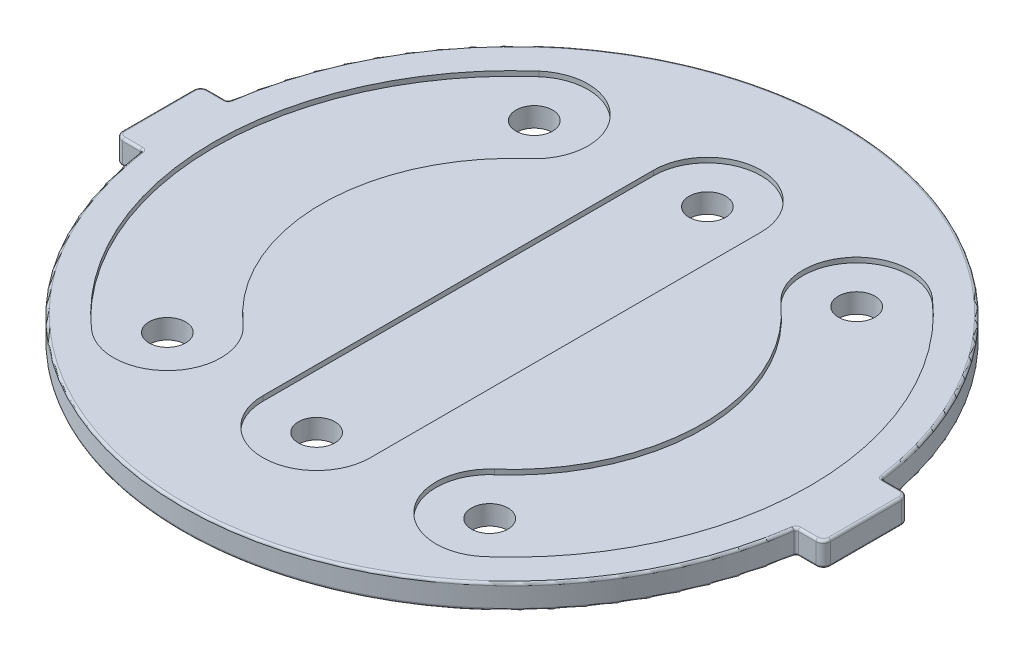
from build123d import *

# Parameters (mm, degrees)
SKETCH2_R      = 7.5
EXTRUDE2_DEPTH = 10
FILLET1_R      = 3
FILLET2_R      = 1
FILLET3_R      = 1
EXTRUDE3_DEPTH = 2


with BuildPart() as part:
    # Sketch2 → Extrude2 (new body)
    with BuildSketch(Plane(origin=(0, 0, 0), x_dir=(-1, 0, 0), z_dir=(0, 1, 0))):
        with BuildLine():
            Line((133.860935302, -17.5), (145, -17.5))
            Line((145, -17.5), (145, 17.5))
            Line((145, 17.5), (133.860935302, 17.5))
            ThreePointArc((133.860935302, 17.5), (0, 135), (-133.860935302, 17.5))
            Line((-133.860935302, 17.5), (-145, 17.5))
            Line((-145, 17.5), (-145, -17.5))
            Line((-145, -17.5), (-133.860935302, -17.5))
            ThreePointArc((-133.860935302, -17.5), (0, -135), (133.860935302, -17.5))
        make_face()
        with Locations(Location((0, -80, 0), (0, 0, 90))):
            Circle(SKETCH2_R, mode=Mode.SUBTRACT)
        with Locations(Location((0, 80, 0), (0, 0, 90))):
            Circle(SKETCH2_R, mode=Mode.SUBTRACT)
        with Locations(Location((65.998314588, -75.128040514, 0), (0, 0, 90))):
            Circle(SKETCH2_R, mode=Mode.SUBTRACT)
        with Locations(Location((65.998314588, 75.128040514, 0), (0, 0, 90))):
            Circle(SKETCH2_R, mode=Mode.SUBTRACT)
        with Locations(Location((-65.998314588, -75.128040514, 0), (0, 0, 90))):
            Circle(SKETCH2_R, mode=Mode.SUBTRACT)
        with Locations(Location((-65.998314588, 75.128040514, 0), (0, 0, 90))):
            Circle(SKETCH2_R, mode=Mode.SUBTRACT)
    extrude(amount=EXTRUDE2_DEPTH)

    # Fillet1
    fillet1_edges = [part.edges().sort_by_distance(p)[0] for p in [
        (-145, 5, 17.5),
        (-145, 5, -17.5),
        (145, 5, 17.5),
        (145, 5, -17.5),
    ]]
    fillet(fillet1_edges, radius=FILLET1_R)

    # Fillet2
    fillet2_edges = [part.edges().sort_by_distance(p)[0] for p in [
        (-133.860935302, 5, -17.5),
        (133.860935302, 5, 17.5),
        (133.860935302, 5, -17.5),
        (-133.860935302, 5, 17.5),
    ]]
    fillet(fillet2_edges, radius=FILLET2_R)

    # Fillet3
    fillet3_edges = [part.edges().sort_by_distance(p)[0] for p in [
        (-145, 0, 0),
        (-145, 10, 0),
        (138.367926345, 0, -17.5),
        (145, 0, 0),
        (138.367926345, 0, 17.5),
        (144.121320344, 0, 16.621320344),
        (144.121320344, 0, -16.621320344),
        (-144.121320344, 0, 16.621320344),
        (-144.121320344, 0, -16.621320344),
        (138.367926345, 10, 17.5),
        (145, 10, 0),
        (138.367926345, 10, -17.5),
        (144.121320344, 10, 16.621320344),
        (144.121320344, 10, -16.621320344),
        (-144.121320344, 10, 16.621320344),
        (-144.121320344, 10, -16.621320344),
        (-138.367926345, 0, -17.5),
        (-138.367926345, 10, -17.5),
        (0, 0, -135),
        (0, 10, -135),
        (0, 0, 135),
        (0, 10, 135),
        (-138.367926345, 10, 17.5),
        (-138.367926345, 0, 17.5),
        (-134.078596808, 0, -17.746332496),
        (-134.078596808, 10, -17.746332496),
        (-134.078596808, 0, 17.746332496),
        (-134.078596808, 10, 17.746332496),
        (134.078596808, 0, -17.746332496),
        (134.078596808, 10, -17.746332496),
        (134.078596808, 0, 17.746332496),
        (134.078596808, 10, 17.746332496),
    ]]
    fillet(fillet3_edges, radius=FILLET3_R)

    # Sketch3 → Extrude3 (cut)
    with BuildSketch(Plane(origin=(0, 10, 0), x_dir=(1, 0, 0), z_dir=(0, 1, 0))):
        with BuildLine():
            Line((-22, 80), (-22, -80))
            ThreePointArc((-22, -80), (0, -102), (22, -80))
            Line((22, -80), (22, 80))
            ThreePointArc((22, 80), (0, 102), (-22, 80))
        make_face()
        with BuildLine():
            ThreePointArc((-51.478685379, 58.599871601), (-78, 0), (-51.478685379, -58.599871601))
            ThreePointArc((-51.478685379, -58.599871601), (-49.470145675, -89.647669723), (-80.517943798, -91.656209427))
            ThreePointArc((-80.517943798, -91.656209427), (-122, 0), (-80.517943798, 91.656209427))
            ThreePointArc((-80.517943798, 91.656209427), (-49.470145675, 89.647669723), (-51.478685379, 58.599871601))
        make_face()
        with BuildLine():
            ThreePointArc((51.478685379, -58.599871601), (78, 0), (51.478685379, 58.599871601))
            ThreePointArc((51.478685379, 58.599871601), (49.470145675, 89.647669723), (80.517943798, 91.656209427))
            ThreePointArc((80.517943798, 91.656209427), (122, 0), (80.517943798, -91.656209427))
            ThreePointArc((80.517943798, -91.656209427), (49.470145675, -89.647669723), (51.478685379, -58.599871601))
        make_face()
    extrude(amount=-EXTRUDE3_DEPTH, mode=Mode.SUBTRACT)


solid = part.part
